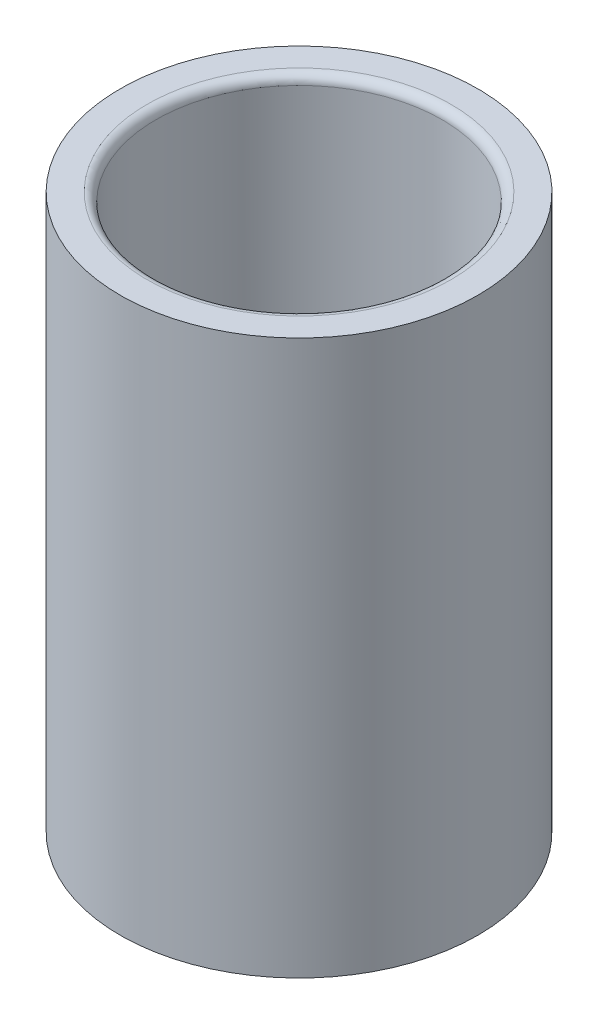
ISO-10303-21;
HEADER;
FILE_DESCRIPTION(('STEP AP214'),'2;1');
FILE_NAME('part.step','',(''),(''),'','','');
FILE_SCHEMA(('AUTOMOTIVE_DESIGN { 1 0 10303 214 1 1 1 1 }'));
ENDSEC;
DATA;
#1=APPLICATION_CONTEXT('core data for automotive mechanical design processes');
#2=APPLICATION_PROTOCOL_DEFINITION('international standard','automotive_design',2000,#1);
#3=PRODUCT_CONTEXT('',#1,'mechanical');
#4=PRODUCT('Part','Part','',(#3));
#5=PRODUCT_RELATED_PRODUCT_CATEGORY('part','',(#4));
#6=PRODUCT_DEFINITION_FORMATION('','',#4);
#7=PRODUCT_DEFINITION_CONTEXT('part definition',#1,'design');
#8=PRODUCT_DEFINITION('design','',#6,#7);
#9=PRODUCT_DEFINITION_SHAPE('','',#8);
#10=(LENGTH_UNIT() NAMED_UNIT(*) SI_UNIT(.MILLI.,.METRE.));
#11=(NAMED_UNIT(*) PLANE_ANGLE_UNIT() SI_UNIT($,.RADIAN.));
#12=(NAMED_UNIT(*) SI_UNIT($,.STERADIAN.) SOLID_ANGLE_UNIT());
#13=UNCERTAINTY_MEASURE_WITH_UNIT(LENGTH_MEASURE(1.E-05),#10,'distance_accuracy_value','');
#14=(GEOMETRIC_REPRESENTATION_CONTEXT(3) GLOBAL_UNCERTAINTY_ASSIGNED_CONTEXT((#13)) GLOBAL_UNIT_ASSIGNED_CONTEXT((#10,
#11,#12)) REPRESENTATION_CONTEXT('',''));
#15=CARTESIAN_POINT('',(0.,0.,0.));
#16=DIRECTION('',(0.,0.,1.));
#17=DIRECTION('',(1.,0.,0.));
#18=AXIS2_PLACEMENT_3D('',#15,#16,#17);
#19=CARTESIAN_POINT('',(-31.75635,98.425,0.));
#20=DIRECTION('',(0.,-1.,0.));
#21=DIRECTION('',(1.,0.,0.));
#22=AXIS2_PLACEMENT_3D('',#19,#20,#21);
#23=PLANE('',#22);
#24=CARTESIAN_POINT('',(-3.43649249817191E-13,98.4250000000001,0.));
#25=DIRECTION('',(0.,-1.,0.));
#26=DIRECTION('',(1.,0.,0.));
#27=AXIS2_PLACEMENT_3D('',#24,#25,#26);
#28=CIRCLE('',#27,26.9811499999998);
#29=CARTESIAN_POINT('',(26.9811499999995,98.4250000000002,0.));
#30=VERTEX_POINT('',#29);
#31=EDGE_CURVE('E43',#30,#30,#28,.T.);
#32=ORIENTED_EDGE('',*,*,#31,.T.);
#33=EDGE_LOOP('',(#32));
#34=FACE_BOUND('',#33,.T.);
#35=CARTESIAN_POINT('',(-3.43649249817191E-13,98.425,0.));
#36=DIRECTION('',(0.,-1.,0.));
#37=DIRECTION('',(1.,0.,0.));
#38=AXIS2_PLACEMENT_3D('',#35,#36,#37);
#39=CIRCLE('',#38,31.7563499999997);
#40=CARTESIAN_POINT('',(31.7563499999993,98.4250000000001,0.));
#41=VERTEX_POINT('',#40);
#42=EDGE_CURVE('E48',#41,#41,#39,.T.);
#43=ORIENTED_EDGE('',*,*,#42,.F.);
#44=EDGE_LOOP('',(#43));
#45=FACE_BOUND('',#44,.T.);
#46=ADVANCED_FACE('F28',(#34,#45),#23,.F.);
#47=CARTESIAN_POINT('',(3.49148336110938E-12,-1000.,0.));
#48=DIRECTION('',(0.,-1.,0.));
#49=DIRECTION('',(1.,0.,0.));
#50=AXIS2_PLACEMENT_3D('',#47,#48,#49);
#51=CYLINDRICAL_SURFACE('',#50,31.7563499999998);
#52=CARTESIAN_POINT('',(0.,0.,0.));
#53=DIRECTION('',(0.,-1.,0.));
#54=DIRECTION('',(1.,0.,0.));
#55=AXIS2_PLACEMENT_3D('',#52,#53,#54);
#56=CIRCLE('',#55,31.75635);
#57=CARTESIAN_POINT('',(31.75635,1.10876767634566E-13,0.));
#58=VERTEX_POINT('',#57);
#59=EDGE_CURVE('E51',#58,#58,#56,.T.);
#60=ORIENTED_EDGE('',*,*,#59,.F.);
#61=EDGE_LOOP('',(#60));
#62=FACE_BOUND('',#61,.T.);
#63=ORIENTED_EDGE('',*,*,#42,.T.);
#64=EDGE_LOOP('',(#63));
#65=FACE_BOUND('',#64,.T.);
#66=ADVANCED_FACE('F57',(#62,#65),#51,.T.);
#67=CARTESIAN_POINT('',(-25.40635,0.,0.));
#68=DIRECTION('',(0.,1.,0.));
#69=DIRECTION('',(-1.,0.,0.));
#70=AXIS2_PLACEMENT_3D('',#67,#68,#69);
#71=PLANE('',#70);
#72=CARTESIAN_POINT('',(0.,0.,0.));
#73=DIRECTION('',(0.,1.,0.));
#74=DIRECTION('',(-1.,0.,0.));
#75=AXIS2_PLACEMENT_3D('',#72,#73,#74);
#76=CIRCLE('',#75,26.9303499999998);
#77=CARTESIAN_POINT('',(-26.9303499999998,0.,0.));
#78=VERTEX_POINT('',#77);
#79=EDGE_CURVE('E10',#78,#78,#76,.T.);
#80=ORIENTED_EDGE('',*,*,#79,.T.);
#81=EDGE_LOOP('',(#80));
#82=FACE_BOUND('',#81,.T.);
#83=ORIENTED_EDGE('',*,*,#59,.T.);
#84=EDGE_LOOP('',(#83));
#85=FACE_BOUND('',#84,.T.);
#86=ADVANCED_FACE('F55',(#82,#85),#71,.F.);
#87=CARTESIAN_POINT('',(3.49148336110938E-12,-1000.,0.));
#88=DIRECTION('',(0.,-1.,0.));
#89=DIRECTION('',(1.,0.,0.));
#90=AXIS2_PLACEMENT_3D('',#87,#88,#89);
#91=CYLINDRICAL_SURFACE('',#90,25.4063499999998);
#92=CARTESIAN_POINT('',(0.,1.52400000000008,0.));
#93=DIRECTION('',(0.,1.,0.));
#94=DIRECTION('',(-1.,0.,0.));
#95=AXIS2_PLACEMENT_3D('',#92,#93,#94);
#96=CIRCLE('',#95,25.4063499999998);
#97=CARTESIAN_POINT('',(-25.4063499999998,1.52399999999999,0.));
#98=VERTEX_POINT('',#97);
#99=EDGE_CURVE('E35',#98,#98,#96,.F.);
#100=ORIENTED_EDGE('',*,*,#99,.T.);
#101=EDGE_LOOP('',(#100));
#102=FACE_BOUND('',#101,.T.);
#103=CARTESIAN_POINT('',(-3.38150861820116E-13,96.8502,0.));
#104=DIRECTION('',(0.,-1.,0.));
#105=DIRECTION('',(1.,0.,0.));
#106=AXIS2_PLACEMENT_3D('',#103,#104,#105);
#107=CIRCLE('',#106,25.4063499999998);
#108=CARTESIAN_POINT('',(25.4063499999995,96.8502000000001,0.));
#109=VERTEX_POINT('',#108);
#110=EDGE_CURVE('E39',#109,#109,#107,.F.);
#111=ORIENTED_EDGE('',*,*,#110,.T.);
#112=EDGE_LOOP('',(#111));
#113=FACE_BOUND('',#112,.T.);
#114=ADVANCED_FACE('F71',(#102,#113),#91,.F.);
#115=CARTESIAN_POINT('',(-3.38150861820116E-13,96.8502,0.));
#116=DIRECTION('',(0.,-1.,0.));
#117=DIRECTION('',(1.,0.,0.));
#118=AXIS2_PLACEMENT_3D('',#115,#116,#117);
#119=TOROIDAL_SURFACE('',#118,26.9811499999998,1.5748);
#120=ORIENTED_EDGE('',*,*,#110,.F.);
#121=EDGE_LOOP('',(#120));
#122=FACE_BOUND('',#121,.T.);
#123=ORIENTED_EDGE('',*,*,#31,.F.);
#124=EDGE_LOOP('',(#123));
#125=FACE_BOUND('',#124,.T.);
#126=ADVANCED_FACE('F69',(#122,#125),#119,.T.);
#127=CARTESIAN_POINT('',(0.,1.52400000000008,0.));
#128=DIRECTION('',(0.,-1.,0.));
#129=DIRECTION('',(1.,0.,0.));
#130=AXIS2_PLACEMENT_3D('',#127,#128,#129);
#131=CONICAL_SURFACE('',#130,25.4063499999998,0.785398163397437);
#132=ORIENTED_EDGE('',*,*,#79,.F.);
#133=EDGE_LOOP('',(#132));
#134=FACE_BOUND('',#133,.T.);
#135=ORIENTED_EDGE('',*,*,#99,.F.);
#136=EDGE_LOOP('',(#135));
#137=FACE_BOUND('',#136,.T.);
#138=ADVANCED_FACE('F30',(#134,#137),#131,.F.);
#139=CLOSED_SHELL('',(#46,#66,#86,#114,#126,#138));
#140=MANIFOLD_SOLID_BREP('B2',#139);
#141=ADVANCED_BREP_SHAPE_REPRESENTATION('',(#18,#140),#14);
#142=SHAPE_DEFINITION_REPRESENTATION(#9,#141);
ENDSEC;
END-ISO-10303-21;
